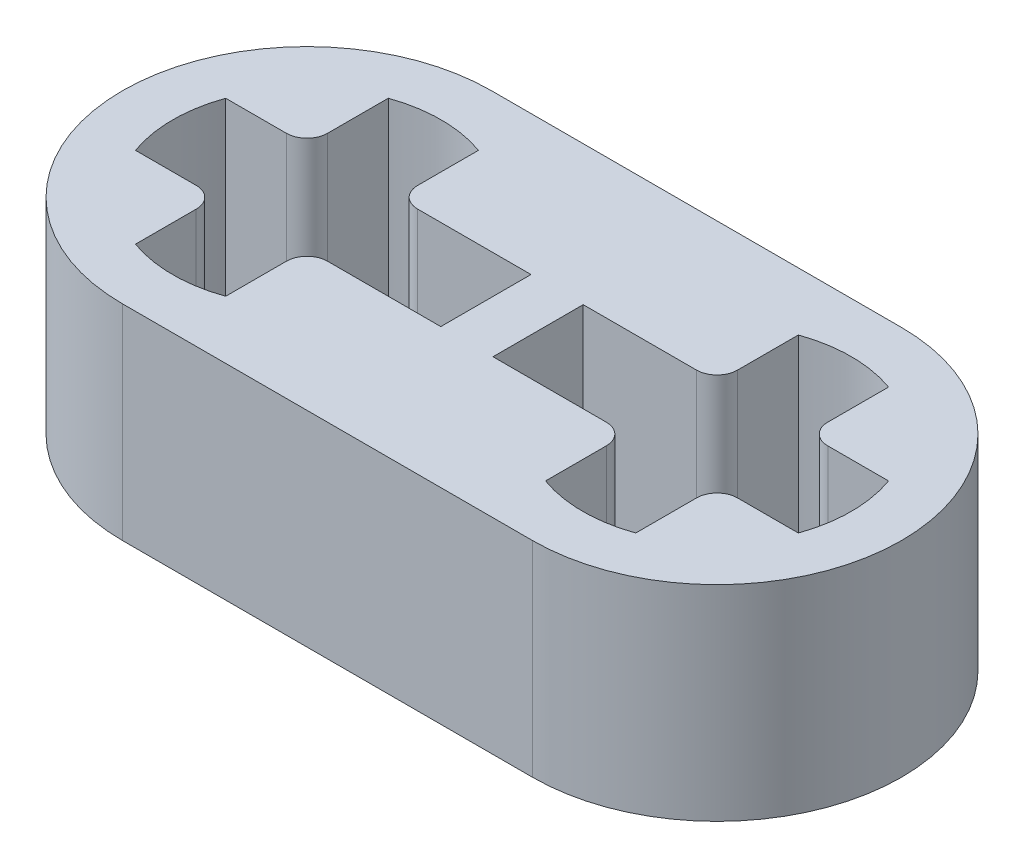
from build123d import *

# Parameters (mm, degrees)
EXTRUDE_1_DEPTH     = 4
CUT_EXTRUDE_1_DEPTH = 10.312357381
CUT_EXTRUDE_2_DEPTH = 10.312357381
FILLET_1_R          = 0.4


with BuildPart() as part:
    # Sketch 1 → Extrude 1 (new body)
    with BuildSketch(Plane.XZ):
        with BuildLine():
            Line((-4, -3.6), (4, -3.6))
            ThreePointArc((4, -3.6), (7.6, 0), (4, 3.6))
            Line((4, 3.6), (-4, 3.6))
            ThreePointArc((-4, 3.6), (-7.6, 0), (-4, -3.6))
        make_face()
    extrude(amount=-EXTRUDE_1_DEPTH)

    # Sketch 2 → Cut-Extrude 1 (cut, through all)
    with BuildSketch(Plane.XZ):
        with BuildLine():
            Line((-0.509212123, 0.88), (-3.12, 0.88))
            Line((-3.12, 0.88), (-3.12, 2.46585516))
            ThreePointArc((-3.12, 2.46585516), (-4, 2.618175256), (-4.88, 2.46585516))
            Line((-4.88, 2.46585516), (-4.88, 0.88))
            Line((-4.88, 0.88), (-6.46585516, 0.88))
            ThreePointArc((-6.46585516, 0.88), (-6.618175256, 0), (-6.46585516, -0.88))
            Line((-6.46585516, -0.88), (-4.88, -0.88))
            Line((-4.88, -0.88), (-4.88, -2.46585516))
            ThreePointArc((-4.88, -2.46585516), (-4, -2.618175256), (-3.12, -2.46585516))
            Line((-3.12, -2.46585516), (-3.12, -0.88))
            Line((-3.12, -0.88), (-0.509212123, -0.88))
            Line((-0.509212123, -0.88), (-0.509212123, 0.88))
        make_face()
    extrude(amount=-CUT_EXTRUDE_1_DEPTH, mode=Mode.SUBTRACT)

    # Sketch 3 → Cut-Extrude 2 (cut, through all)
    with BuildSketch(Plane(origin=(0, 4, 0), x_dir=(-1, 0, 0), z_dir=(0, 1, 0))):
        with BuildLine():
            Line((-0.509212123, 0.88), (-3.12, 0.88))
            Line((-3.12, 0.88), (-3.12, 2.46585516))
            ThreePointArc((-3.12, 2.46585516), (-4, 2.618175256), (-4.88, 2.46585516))
            Line((-4.88, 2.46585516), (-4.88, 0.88))
            Line((-4.88, 0.88), (-6.46585516, 0.88))
            ThreePointArc((-6.46585516, 0.88), (-6.618175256, 0), (-6.46585516, -0.88))
            Line((-6.46585516, -0.88), (-4.88, -0.88))
            Line((-4.88, -0.88), (-4.88, -2.46585516))
            ThreePointArc((-4.88, -2.46585516), (-4, -2.618175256), (-3.12, -2.46585516))
            Line((-3.12, -2.46585516), (-3.12, -0.88))
            Line((-3.12, -0.88), (-0.509212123, -0.88))
            Line((-0.509212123, -0.88), (-0.509212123, 0.88))
        make_face()
    extrude(amount=-CUT_EXTRUDE_2_DEPTH, mode=Mode.SUBTRACT)

    # Fillet 1
    fillet_1_edges = [part.edges().sort_by_distance(p)[0] for p in [
        (-3.12, 2, -0.88),
        (-4.88, 2, -0.88),
        (-4.88, 2, 0.88),
        (-3.12, 2, 0.88),
        (3.12, 2, -0.88),
        (4.88, 2, -0.88),
        (4.88, 2, 0.88),
        (3.12, 2, 0.88),
    ]]
    fillet(fillet_1_edges, radius=FILLET_1_R)


solid = part.part
